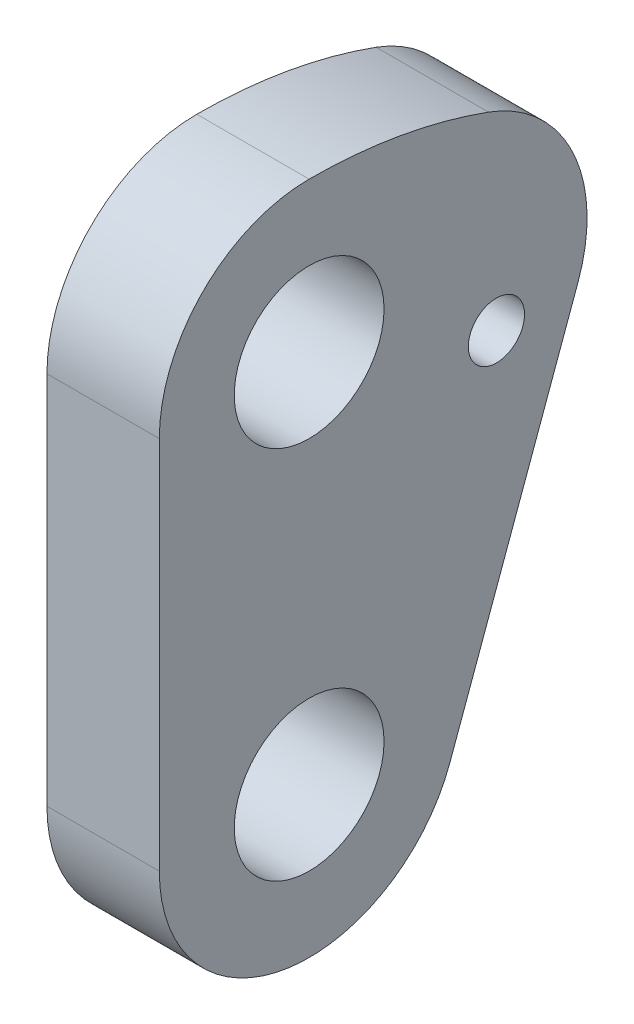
ISO-10303-21;
HEADER;
FILE_DESCRIPTION(('STEP AP214'),'2;1');
FILE_NAME('part.step','',(''),(''),'','','');
FILE_SCHEMA(('AUTOMOTIVE_DESIGN { 1 0 10303 214 1 1 1 1 }'));
ENDSEC;
DATA;
#1=APPLICATION_CONTEXT('core data for automotive mechanical design processes');
#2=APPLICATION_PROTOCOL_DEFINITION('international standard','automotive_design',2000,#1);
#3=PRODUCT_CONTEXT('',#1,'mechanical');
#4=PRODUCT('Part','Part','',(#3));
#5=PRODUCT_RELATED_PRODUCT_CATEGORY('part','',(#4));
#6=PRODUCT_DEFINITION_FORMATION('','',#4);
#7=PRODUCT_DEFINITION_CONTEXT('part definition',#1,'design');
#8=PRODUCT_DEFINITION('design','',#6,#7);
#9=PRODUCT_DEFINITION_SHAPE('','',#8);
#10=(LENGTH_UNIT() NAMED_UNIT(*) SI_UNIT(.MILLI.,.METRE.));
#11=(NAMED_UNIT(*) PLANE_ANGLE_UNIT() SI_UNIT($,.RADIAN.));
#12=(NAMED_UNIT(*) SI_UNIT($,.STERADIAN.) SOLID_ANGLE_UNIT());
#13=UNCERTAINTY_MEASURE_WITH_UNIT(LENGTH_MEASURE(1.E-05),#10,'distance_accuracy_value','');
#14=(GEOMETRIC_REPRESENTATION_CONTEXT(3) GLOBAL_UNCERTAINTY_ASSIGNED_CONTEXT((#13)) GLOBAL_UNIT_ASSIGNED_CONTEXT((#10,
#11,#12)) REPRESENTATION_CONTEXT('',''));
#15=CARTESIAN_POINT('',(0.,0.,0.));
#16=DIRECTION('',(0.,0.,1.));
#17=DIRECTION('',(1.,0.,0.));
#18=AXIS2_PLACEMENT_3D('',#15,#16,#17);
#19=CARTESIAN_POINT('',(3.,9.39692620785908,-3.42020143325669));
#20=DIRECTION('',(1.,0.,0.));
#21=DIRECTION('',(0.,0.,-1.));
#22=AXIS2_PLACEMENT_3D('',#19,#20,#21);
#23=PLANE('',#22);
#24=CARTESIAN_POINT('',(3.,8.,-5.));
#25=DIRECTION('',(1.,0.,0.));
#26=DIRECTION('',(0.,0.,-1.));
#27=AXIS2_PLACEMENT_3D('',#24,#25,#26);
#28=CIRCLE('',#27,0.750000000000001);
#29=CARTESIAN_POINT('',(3.,8.,-5.75));
#30=VERTEX_POINT('',#29);
#31=EDGE_CURVE('E179',#30,#30,#28,.T.);
#32=ORIENTED_EDGE('',*,*,#31,.F.);
#33=EDGE_LOOP('',(#32));
#34=FACE_BOUND('',#33,.T.);
#35=CARTESIAN_POINT('',(3.,0.,0.));
#36=DIRECTION('',(1.,0.,0.));
#37=DIRECTION('',(0.,0.,-1.));
#38=AXIS2_PLACEMENT_3D('',#35,#36,#37);
#39=CIRCLE('',#38,2.);
#40=CARTESIAN_POINT('',(3.,0.,-2.));
#41=VERTEX_POINT('',#40);
#42=EDGE_CURVE('E122',#41,#41,#39,.T.);
#43=ORIENTED_EDGE('',*,*,#42,.F.);
#44=EDGE_LOOP('',(#43));
#45=FACE_BOUND('',#44,.T.);
#46=CARTESIAN_POINT('',(3.,9.39692620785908,-3.42020143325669));
#47=DIRECTION('',(1.,0.,0.));
#48=DIRECTION('',(0.,0.,-1.));
#49=AXIS2_PLACEMENT_3D('',#46,#47,#48);
#50=CIRCLE('',#49,4.);
#51=CARTESIAN_POINT('',(3.,8.0288456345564,-7.17897191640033));
#52=VERTEX_POINT('',#51);
#53=CARTESIAN_POINT('',(3.,13.1556966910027,-4.78828200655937));
#54=VERTEX_POINT('',#53);
#55=EDGE_CURVE('E129',#52,#54,#50,.T.);
#56=ORIENTED_EDGE('',*,*,#55,.T.);
#57=CARTESIAN_POINT('',(3.,0.,0.));
#58=DIRECTION('',(1.,0.,0.));
#59=DIRECTION('',(0.,0.,1.));
#60=AXIS2_PLACEMENT_3D('',#57,#58,#59);
#61=CIRCLE('',#60,14.);
#62=CARTESIAN_POINT('',(3.,14.,0.));
#63=VERTEX_POINT('',#62);
#64=EDGE_CURVE('E87',#54,#63,#61,.T.);
#65=ORIENTED_EDGE('',*,*,#64,.T.);
#66=CARTESIAN_POINT('',(3.,10.,0.));
#67=DIRECTION('',(1.,0.,0.));
#68=DIRECTION('',(0.,0.,-1.));
#69=AXIS2_PLACEMENT_3D('',#66,#67,#68);
#70=CIRCLE('',#69,4.);
#71=CARTESIAN_POINT('',(3.,10.,4.));
#72=VERTEX_POINT('',#71);
#73=EDGE_CURVE('E100',#63,#72,#70,.T.);
#74=ORIENTED_EDGE('',*,*,#73,.T.);
#75=DIRECTION('',(0.,-1.,0.));
#76=VECTOR('',#75,1.);
#77=CARTESIAN_POINT('',(3.,10.,4.));
#78=LINE('',#77,#76);
#79=CARTESIAN_POINT('',(3.,0.,4.));
#80=VERTEX_POINT('',#79);
#81=EDGE_CURVE('E94',#72,#80,#78,.T.);
#82=ORIENTED_EDGE('',*,*,#81,.T.);
#83=CARTESIAN_POINT('',(3.,0.,0.));
#84=DIRECTION('',(1.,0.,0.));
#85=DIRECTION('',(0.,0.,-1.));
#86=AXIS2_PLACEMENT_3D('',#83,#84,#85);
#87=CIRCLE('',#86,4.);
#88=CARTESIAN_POINT('',(3.,-1.36808057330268,-3.75877048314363));
#89=VERTEX_POINT('',#88);
#90=EDGE_CURVE('E98',#80,#89,#87,.T.);
#91=ORIENTED_EDGE('',*,*,#90,.T.);
#92=DIRECTION('',(0.,0.939692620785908,-0.342020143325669));
#93=VECTOR('',#92,1.);
#94=CARTESIAN_POINT('',(3.,-1.36808057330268,-3.75877048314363));
#95=LINE('',#94,#93);
#96=EDGE_CURVE('E50',#89,#52,#95,.T.);
#97=ORIENTED_EDGE('',*,*,#96,.T.);
#98=EDGE_LOOP('',(#56,#65,#74,#82,#91,#97));
#99=FACE_BOUND('',#98,.T.);
#100=CARTESIAN_POINT('',(3.,10.,0.));
#101=DIRECTION('',(1.,0.,0.));
#102=DIRECTION('',(0.,0.,-1.));
#103=AXIS2_PLACEMENT_3D('',#100,#101,#102);
#104=CIRCLE('',#103,2.);
#105=CARTESIAN_POINT('',(3.,10.,-2.));
#106=VERTEX_POINT('',#105);
#107=EDGE_CURVE('E184',#106,#106,#104,.T.);
#108=ORIENTED_EDGE('',*,*,#107,.F.);
#109=EDGE_LOOP('',(#108));
#110=FACE_BOUND('',#109,.T.);
#111=ADVANCED_FACE('F33',(#34,#45,#99,#110),#23,.T.);
#112=CARTESIAN_POINT('',(0.,9.39692620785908,-3.42020143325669));
#113=DIRECTION('',(1.,0.,0.));
#114=DIRECTION('',(0.,0.,-1.));
#115=AXIS2_PLACEMENT_3D('',#112,#113,#114);
#116=PLANE('',#115);
#117=CARTESIAN_POINT('',(0.,8.,-5.));
#118=DIRECTION('',(1.,0.,0.));
#119=DIRECTION('',(0.,0.,-1.));
#120=AXIS2_PLACEMENT_3D('',#117,#118,#119);
#121=CIRCLE('',#120,0.750000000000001);
#122=CARTESIAN_POINT('',(0.,8.,-5.75));
#123=VERTEX_POINT('',#122);
#124=EDGE_CURVE('E177',#123,#123,#121,.T.);
#125=ORIENTED_EDGE('',*,*,#124,.T.);
#126=EDGE_LOOP('',(#125));
#127=FACE_BOUND('',#126,.T.);
#128=CARTESIAN_POINT('',(0.,0.,0.));
#129=DIRECTION('',(1.,0.,0.));
#130=DIRECTION('',(0.,0.,-1.));
#131=AXIS2_PLACEMENT_3D('',#128,#129,#130);
#132=CIRCLE('',#131,2.);
#133=CARTESIAN_POINT('',(0.,0.,-2.));
#134=VERTEX_POINT('',#133);
#135=EDGE_CURVE('E187',#134,#134,#132,.T.);
#136=ORIENTED_EDGE('',*,*,#135,.T.);
#137=EDGE_LOOP('',(#136));
#138=FACE_BOUND('',#137,.T.);
#139=CARTESIAN_POINT('',(0.,9.39692620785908,-3.42020143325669));
#140=DIRECTION('',(1.,0.,0.));
#141=DIRECTION('',(0.,0.,-1.));
#142=AXIS2_PLACEMENT_3D('',#139,#140,#141);
#143=CIRCLE('',#142,4.);
#144=CARTESIAN_POINT('',(0.,8.0288456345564,-7.17897191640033));
#145=VERTEX_POINT('',#144);
#146=CARTESIAN_POINT('',(0.,13.1556966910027,-4.78828200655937));
#147=VERTEX_POINT('',#146);
#148=EDGE_CURVE('E118',#145,#147,#143,.T.);
#149=ORIENTED_EDGE('',*,*,#148,.F.);
#150=DIRECTION('',(0.,0.939692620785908,-0.342020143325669));
#151=VECTOR('',#150,1.);
#152=CARTESIAN_POINT('',(0.,-1.36808057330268,-3.75877048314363));
#153=LINE('',#152,#151);
#154=CARTESIAN_POINT('',(0.,-1.36808057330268,-3.75877048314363));
#155=VERTEX_POINT('',#154);
#156=EDGE_CURVE('E79',#155,#145,#153,.T.);
#157=ORIENTED_EDGE('',*,*,#156,.F.);
#158=CARTESIAN_POINT('',(0.,0.,0.));
#159=DIRECTION('',(1.,0.,0.));
#160=DIRECTION('',(0.,0.,-1.));
#161=AXIS2_PLACEMENT_3D('',#158,#159,#160);
#162=CIRCLE('',#161,4.);
#163=CARTESIAN_POINT('',(0.,0.,4.));
#164=VERTEX_POINT('',#163);
#165=EDGE_CURVE('E73',#164,#155,#162,.T.);
#166=ORIENTED_EDGE('',*,*,#165,.F.);
#167=DIRECTION('',(0.,-1.,0.));
#168=VECTOR('',#167,1.);
#169=CARTESIAN_POINT('',(0.,10.,4.));
#170=LINE('',#169,#168);
#171=CARTESIAN_POINT('',(0.,10.,4.));
#172=VERTEX_POINT('',#171);
#173=EDGE_CURVE('E108',#172,#164,#170,.T.);
#174=ORIENTED_EDGE('',*,*,#173,.F.);
#175=CARTESIAN_POINT('',(0.,10.,0.));
#176=DIRECTION('',(1.,0.,0.));
#177=DIRECTION('',(0.,0.,-1.));
#178=AXIS2_PLACEMENT_3D('',#175,#176,#177);
#179=CIRCLE('',#178,4.);
#180=CARTESIAN_POINT('',(0.,14.,0.));
#181=VERTEX_POINT('',#180);
#182=EDGE_CURVE('E124',#181,#172,#179,.T.);
#183=ORIENTED_EDGE('',*,*,#182,.F.);
#184=CARTESIAN_POINT('',(0.,0.,0.));
#185=DIRECTION('',(1.,0.,0.));
#186=DIRECTION('',(0.,0.,1.));
#187=AXIS2_PLACEMENT_3D('',#184,#185,#186);
#188=CIRCLE('',#187,14.);
#189=EDGE_CURVE('E121',#147,#181,#188,.T.);
#190=ORIENTED_EDGE('',*,*,#189,.F.);
#191=EDGE_LOOP('',(#149,#157,#166,#174,#183,#190));
#192=FACE_BOUND('',#191,.T.);
#193=CARTESIAN_POINT('',(0.,10.,0.));
#194=DIRECTION('',(1.,0.,0.));
#195=DIRECTION('',(0.,0.,-1.));
#196=AXIS2_PLACEMENT_3D('',#193,#194,#195);
#197=CIRCLE('',#196,2.);
#198=CARTESIAN_POINT('',(0.,10.,-2.));
#199=VERTEX_POINT('',#198);
#200=EDGE_CURVE('E181',#199,#199,#197,.T.);
#201=ORIENTED_EDGE('',*,*,#200,.T.);
#202=EDGE_LOOP('',(#201));
#203=FACE_BOUND('',#202,.T.);
#204=ADVANCED_FACE('F138',(#127,#138,#192,#203),#116,.F.);
#205=CARTESIAN_POINT('',(3.,9.39692620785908,-3.42020143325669));
#206=DIRECTION('',(-1.,0.,0.));
#207=DIRECTION('',(0.,0.,1.));
#208=AXIS2_PLACEMENT_3D('',#205,#206,#207);
#209=CYLINDRICAL_SURFACE('',#208,4.);
#210=ORIENTED_EDGE('',*,*,#148,.T.);
#211=DIRECTION('',(-1.,0.,0.));
#212=VECTOR('',#211,1.);
#213=CARTESIAN_POINT('',(3.,13.1556966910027,-4.78828200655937));
#214=LINE('',#213,#212);
#215=EDGE_CURVE('E11',#54,#147,#214,.T.);
#216=ORIENTED_EDGE('',*,*,#215,.F.);
#217=ORIENTED_EDGE('',*,*,#55,.F.);
#218=DIRECTION('',(-1.,0.,0.));
#219=VECTOR('',#218,1.);
#220=CARTESIAN_POINT('',(3.,8.0288456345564,-7.17897191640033));
#221=LINE('',#220,#219);
#222=EDGE_CURVE('E114',#52,#145,#221,.T.);
#223=ORIENTED_EDGE('',*,*,#222,.T.);
#224=EDGE_LOOP('',(#210,#216,#217,#223));
#225=FACE_BOUND('',#224,.T.);
#226=ADVANCED_FACE('F35',(#225),#209,.T.);
#227=CARTESIAN_POINT('',(3.,0.,0.));
#228=DIRECTION('',(-1.,0.,0.));
#229=DIRECTION('',(0.,0.,1.));
#230=AXIS2_PLACEMENT_3D('',#227,#228,#229);
#231=CYLINDRICAL_SURFACE('',#230,14.);
#232=ORIENTED_EDGE('',*,*,#189,.T.);
#233=DIRECTION('',(-1.,0.,0.));
#234=VECTOR('',#233,1.);
#235=CARTESIAN_POINT('',(3.,14.,0.));
#236=LINE('',#235,#234);
#237=EDGE_CURVE('E42',#63,#181,#236,.T.);
#238=ORIENTED_EDGE('',*,*,#237,.F.);
#239=ORIENTED_EDGE('',*,*,#64,.F.);
#240=ORIENTED_EDGE('',*,*,#215,.T.);
#241=EDGE_LOOP('',(#232,#238,#239,#240));
#242=FACE_BOUND('',#241,.T.);
#243=ADVANCED_FACE('F238',(#242),#231,.T.);
#244=CARTESIAN_POINT('',(3.,10.,0.));
#245=DIRECTION('',(-1.,0.,0.));
#246=DIRECTION('',(0.,0.,1.));
#247=AXIS2_PLACEMENT_3D('',#244,#245,#246);
#248=CYLINDRICAL_SURFACE('',#247,4.);
#249=ORIENTED_EDGE('',*,*,#182,.T.);
#250=DIRECTION('',(-1.,0.,0.));
#251=VECTOR('',#250,1.);
#252=CARTESIAN_POINT('',(3.,10.,4.));
#253=LINE('',#252,#251);
#254=EDGE_CURVE('E109',#72,#172,#253,.T.);
#255=ORIENTED_EDGE('',*,*,#254,.F.);
#256=ORIENTED_EDGE('',*,*,#73,.F.);
#257=ORIENTED_EDGE('',*,*,#237,.T.);
#258=EDGE_LOOP('',(#249,#255,#256,#257));
#259=FACE_BOUND('',#258,.T.);
#260=ADVANCED_FACE('F135',(#259),#248,.T.);
#261=CARTESIAN_POINT('',(3.,10.,4.));
#262=DIRECTION('',(0.,0.,-1.));
#263=DIRECTION('',(0.,1.,0.));
#264=AXIS2_PLACEMENT_3D('',#261,#262,#263);
#265=PLANE('',#264);
#266=ORIENTED_EDGE('',*,*,#173,.T.);
#267=DIRECTION('',(-1.,0.,0.));
#268=VECTOR('',#267,1.);
#269=CARTESIAN_POINT('',(3.,0.,4.));
#270=LINE('',#269,#268);
#271=EDGE_CURVE('E105',#80,#164,#270,.T.);
#272=ORIENTED_EDGE('',*,*,#271,.F.);
#273=ORIENTED_EDGE('',*,*,#81,.F.);
#274=ORIENTED_EDGE('',*,*,#254,.T.);
#275=EDGE_LOOP('',(#266,#272,#273,#274));
#276=FACE_BOUND('',#275,.T.);
#277=ADVANCED_FACE('F106',(#276),#265,.F.);
#278=CARTESIAN_POINT('',(3.,0.,0.));
#279=DIRECTION('',(-1.,0.,0.));
#280=DIRECTION('',(0.,0.,1.));
#281=AXIS2_PLACEMENT_3D('',#278,#279,#280);
#282=CYLINDRICAL_SURFACE('',#281,4.);
#283=ORIENTED_EDGE('',*,*,#165,.T.);
#284=DIRECTION('',(-1.,0.,0.));
#285=VECTOR('',#284,1.);
#286=CARTESIAN_POINT('',(3.,-1.36808057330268,-3.75877048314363));
#287=LINE('',#286,#285);
#288=EDGE_CURVE('E110',#89,#155,#287,.T.);
#289=ORIENTED_EDGE('',*,*,#288,.F.);
#290=ORIENTED_EDGE('',*,*,#90,.F.);
#291=ORIENTED_EDGE('',*,*,#271,.T.);
#292=EDGE_LOOP('',(#283,#289,#290,#291));
#293=FACE_BOUND('',#292,.T.);
#294=ADVANCED_FACE('F112',(#293),#282,.T.);
#295=CARTESIAN_POINT('',(3.,-1.36808057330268,-3.75877048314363));
#296=DIRECTION('',(0.,0.342020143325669,0.939692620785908));
#297=DIRECTION('',(0.,-0.939692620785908,0.342020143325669));
#298=AXIS2_PLACEMENT_3D('',#295,#296,#297);
#299=PLANE('',#298);
#300=ORIENTED_EDGE('',*,*,#156,.T.);
#301=ORIENTED_EDGE('',*,*,#222,.F.);
#302=ORIENTED_EDGE('',*,*,#96,.F.);
#303=ORIENTED_EDGE('',*,*,#288,.T.);
#304=EDGE_LOOP('',(#300,#301,#302,#303));
#305=FACE_BOUND('',#304,.T.);
#306=ADVANCED_FACE('F143',(#305),#299,.F.);
#307=CARTESIAN_POINT('',(3.,0.,0.));
#308=DIRECTION('',(-1.,0.,0.));
#309=DIRECTION('',(0.,0.,1.));
#310=AXIS2_PLACEMENT_3D('',#307,#308,#309);
#311=CYLINDRICAL_SURFACE('',#310,2.);
#312=ORIENTED_EDGE('',*,*,#42,.T.);
#313=EDGE_LOOP('',(#312));
#314=FACE_BOUND('',#313,.T.);
#315=ORIENTED_EDGE('',*,*,#135,.F.);
#316=EDGE_LOOP('',(#315));
#317=FACE_BOUND('',#316,.T.);
#318=ADVANCED_FACE('F145',(#314,#317),#311,.F.);
#319=CARTESIAN_POINT('',(3.,10.,0.));
#320=DIRECTION('',(-1.,0.,0.));
#321=DIRECTION('',(0.,0.,1.));
#322=AXIS2_PLACEMENT_3D('',#319,#320,#321);
#323=CYLINDRICAL_SURFACE('',#322,2.);
#324=ORIENTED_EDGE('',*,*,#107,.T.);
#325=EDGE_LOOP('',(#324));
#326=FACE_BOUND('',#325,.T.);
#327=ORIENTED_EDGE('',*,*,#200,.F.);
#328=EDGE_LOOP('',(#327));
#329=FACE_BOUND('',#328,.T.);
#330=ADVANCED_FACE('F151',(#326,#329),#323,.F.);
#331=CARTESIAN_POINT('',(0.,8.,-5.));
#332=DIRECTION('',(1.,0.,0.));
#333=DIRECTION('',(0.,0.,-1.));
#334=AXIS2_PLACEMENT_3D('',#331,#332,#333);
#335=CYLINDRICAL_SURFACE('',#334,0.750000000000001);
#336=ORIENTED_EDGE('',*,*,#124,.F.);
#337=EDGE_LOOP('',(#336));
#338=FACE_BOUND('',#337,.T.);
#339=ORIENTED_EDGE('',*,*,#31,.T.);
#340=EDGE_LOOP('',(#339));
#341=FACE_BOUND('',#340,.T.);
#342=ADVANCED_FACE('F168',(#338,#341),#335,.F.);
#343=CLOSED_SHELL('',(#111,#204,#226,#243,#260,#277,#294,#306,#318,#330,#342));
#344=MANIFOLD_SOLID_BREP('B2',#343);
#345=ADVANCED_BREP_SHAPE_REPRESENTATION('',(#18,#344),#14);
#346=SHAPE_DEFINITION_REPRESENTATION(#9,#345);
ENDSEC;
END-ISO-10303-21;
